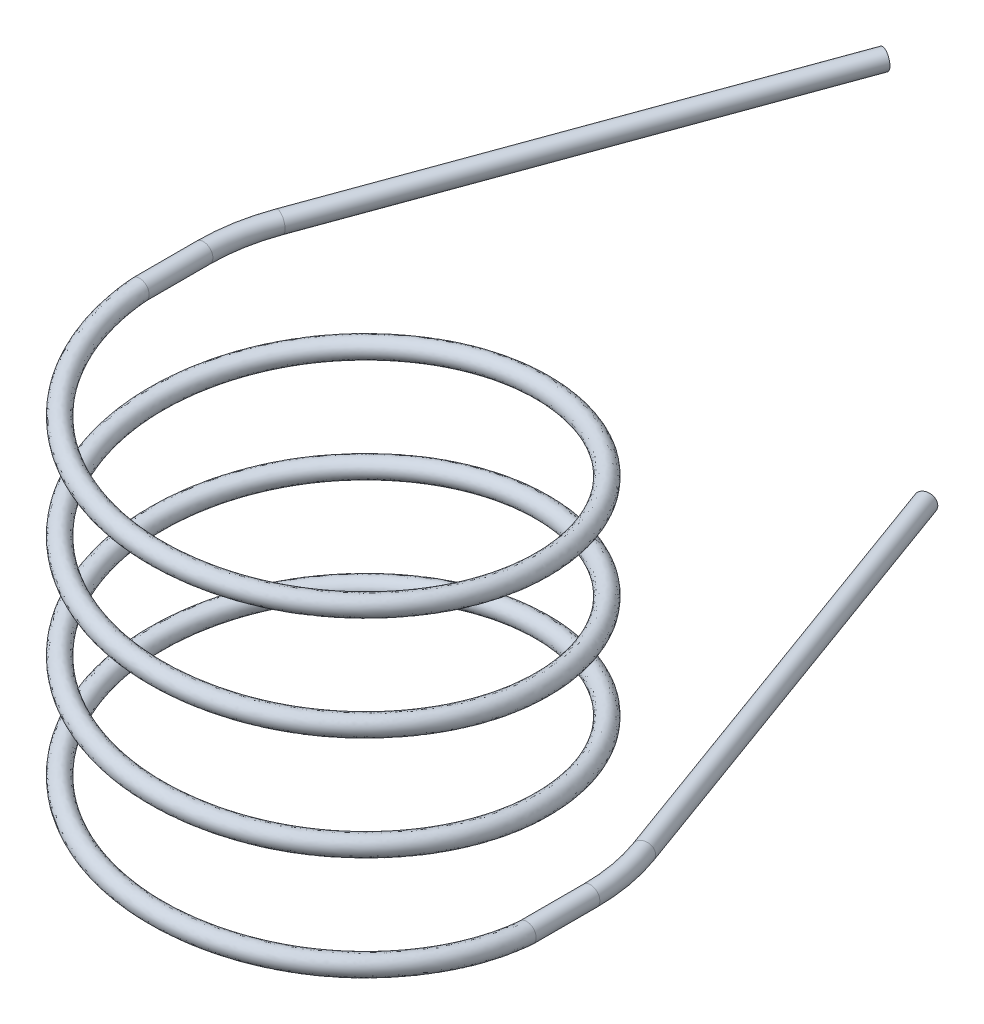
ISO-10303-21;
HEADER;
FILE_DESCRIPTION(('STEP AP214'),'2;1');
FILE_NAME('part.step','',(''),(''),'','','');
FILE_SCHEMA(('AUTOMOTIVE_DESIGN { 1 0 10303 214 1 1 1 1 }'));
ENDSEC;
DATA;
#1=APPLICATION_CONTEXT('core data for automotive mechanical design processes');
#2=APPLICATION_PROTOCOL_DEFINITION('international standard','automotive_design',2000,#1);
#3=PRODUCT_CONTEXT('',#1,'mechanical');
#4=PRODUCT('Part','Part','',(#3));
#5=PRODUCT_RELATED_PRODUCT_CATEGORY('part','',(#4));
#6=PRODUCT_DEFINITION_FORMATION('','',#4);
#7=PRODUCT_DEFINITION_CONTEXT('part definition',#1,'design');
#8=PRODUCT_DEFINITION('design','',#6,#7);
#9=PRODUCT_DEFINITION_SHAPE('','',#8);
#10=(LENGTH_UNIT() NAMED_UNIT(*) SI_UNIT(.MILLI.,.METRE.));
#11=(NAMED_UNIT(*) PLANE_ANGLE_UNIT() SI_UNIT($,.RADIAN.));
#12=(NAMED_UNIT(*) SI_UNIT($,.STERADIAN.) SOLID_ANGLE_UNIT());
#13=UNCERTAINTY_MEASURE_WITH_UNIT(LENGTH_MEASURE(1.E-05),#10,'distance_accuracy_value','');
#14=(GEOMETRIC_REPRESENTATION_CONTEXT(3) GLOBAL_UNCERTAINTY_ASSIGNED_CONTEXT((#13)) GLOBAL_UNIT_ASSIGNED_CONTEXT((#10,
#11,#12)) REPRESENTATION_CONTEXT('',''));
#15=CARTESIAN_POINT('',(0.,0.,0.));
#16=DIRECTION('',(0.,0.,1.));
#17=DIRECTION('',(1.,0.,0.));
#18=AXIS2_PLACEMENT_3D('',#15,#16,#17);
#19=CARTESIAN_POINT('',(-20.4999999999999,0.,-8.56393883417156E-13));
#20=DIRECTION('',(0.,0.,-1.));
#21=DIRECTION('',(-1.,0.,0.));
#22=AXIS2_PLACEMENT_3D('',#19,#20,#21);
#23=PLANE('',#22);
#24=CARTESIAN_POINT('',(-20.4999999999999,0.,-8.56393883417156E-13));
#25=DIRECTION('',(0.,0.,-1.));
#26=DIRECTION('',(-1.,0.,0.));
#27=AXIS2_PLACEMENT_3D('',#24,#25,#26);
#28=CIRCLE('',#27,1.);
#29=CARTESIAN_POINT('',(-19.5000007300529,-0.00120834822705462,-8.14618602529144E-13));
#30=VERTEX_POINT('',#29);
#31=CARTESIAN_POINT('',(-21.4999999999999,0.,-8.98169194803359E-13));
#32=VERTEX_POINT('',#31);
#33=EDGE_CURVE('E64',#30,#32,#28,.T.);
#34=ORIENTED_EDGE('',*,*,#33,.T.);
#35=CARTESIAN_POINT('',(-20.4999999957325,0.000418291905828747,-8.56394463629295E-13));
#36=DIRECTION('',(0.,0.,-1.));
#37=DIRECTION('',(-1.,0.,0.));
#38=AXIS2_PLACEMENT_3D('',#35,#36,#37);
#39=CIRCLE('',#38,1.);
#40=EDGE_CURVE('E47',#30,#32,#39,.T.);
#41=ORIENTED_EDGE('',*,*,#40,.F.);
#42=EDGE_LOOP('',(#34,#41));
#43=FACE_BOUND('',#42,.T.);
#44=ADVANCED_FACE('F33',(#43),#23,.T.);
#45=CARTESIAN_POINT('',(21.4999999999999,-38.5,-1.70429937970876E-13));
#46=CARTESIAN_POINT('',(21.5,-37.8125,8.90559159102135));
#47=CARTESIAN_POINT('',(15.2027957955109,-37.125,15.2027957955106));
#48=CARTESIAN_POINT('',(8.90559159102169,-36.4375,21.4999999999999));
#49=CARTESIAN_POINT('',(1.7174643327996E-13,-35.75,21.4999999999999));
#50=CARTESIAN_POINT('',(-8.90559159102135,-35.0625,21.5));
#51=CARTESIAN_POINT('',(-15.2027957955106,-34.375,15.2027957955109));
#52=CARTESIAN_POINT('',(-21.4999999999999,-33.6875,8.90559159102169));
#53=CARTESIAN_POINT('',(-21.4999999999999,-33.,1.73062928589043E-13));
#54=CARTESIAN_POINT('',(-21.5,-32.3125,-8.90559159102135));
#55=CARTESIAN_POINT('',(-15.2027957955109,-31.625,-15.2027957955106));
#56=CARTESIAN_POINT('',(-8.9055915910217,-30.9375,-21.4999999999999));
#57=CARTESIAN_POINT('',(-1.74379423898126E-13,-30.25,-21.4999999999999));
#58=CARTESIAN_POINT('',(8.90559159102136,-29.5625,-21.5));
#59=CARTESIAN_POINT('',(15.2027957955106,-28.875,-15.2027957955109));
#60=CARTESIAN_POINT('',(21.4999999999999,-28.1875,-8.9055915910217));
#61=CARTESIAN_POINT('',(21.4999999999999,-27.5,-1.70429937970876E-13));
#62=CARTESIAN_POINT('',(21.5,-26.8125,8.90559159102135));
#63=CARTESIAN_POINT('',(15.2027957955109,-26.125,15.2027957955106));
#64=CARTESIAN_POINT('',(8.90559159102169,-25.4375,21.4999999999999));
#65=CARTESIAN_POINT('',(1.7174643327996E-13,-24.75,21.4999999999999));
#66=CARTESIAN_POINT('',(-8.90559159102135,-24.0625,21.5));
#67=CARTESIAN_POINT('',(-15.2027957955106,-23.375,15.2027957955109));
#68=CARTESIAN_POINT('',(-21.4999999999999,-22.6875,8.90559159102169));
#69=CARTESIAN_POINT('',(-21.4999999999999,-22.,1.73062928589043E-13));
#70=CARTESIAN_POINT('',(-21.5,-21.3125,-8.90559159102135));
#71=CARTESIAN_POINT('',(-15.2027957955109,-20.625,-15.2027957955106));
#72=CARTESIAN_POINT('',(-8.9055915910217,-19.9375,-21.4999999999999));
#73=CARTESIAN_POINT('',(-1.74379423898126E-13,-19.25,-21.4999999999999));
#74=CARTESIAN_POINT('',(8.90559159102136,-18.5625,-21.5));
#75=CARTESIAN_POINT('',(15.2027957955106,-17.875,-15.2027957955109));
#76=CARTESIAN_POINT('',(21.4999999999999,-17.1875,-8.9055915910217));
#77=CARTESIAN_POINT('',(21.4999999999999,-16.5,-1.70429937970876E-13));
#78=CARTESIAN_POINT('',(21.5,-15.8125,8.90559159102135));
#79=CARTESIAN_POINT('',(15.2027957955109,-15.125,15.2027957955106));
#80=CARTESIAN_POINT('',(8.90559159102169,-14.4375,21.4999999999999));
#81=CARTESIAN_POINT('',(1.7174643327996E-13,-13.75,21.4999999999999));
#82=CARTESIAN_POINT('',(-8.90559159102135,-13.0625,21.5));
#83=CARTESIAN_POINT('',(-15.2027957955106,-12.375,15.2027957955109));
#84=CARTESIAN_POINT('',(-21.4999999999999,-11.6875,8.90559159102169));
#85=CARTESIAN_POINT('',(-21.4999999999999,-11.,1.73062928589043E-13));
#86=CARTESIAN_POINT('',(-21.5,-10.3125000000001,-8.90559159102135));
#87=CARTESIAN_POINT('',(-15.2027957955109,-9.62500000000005,-15.2027957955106));
#88=CARTESIAN_POINT('',(-8.9055915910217,-8.93750000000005,-21.4999999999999));
#89=CARTESIAN_POINT('',(-1.74379423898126E-13,-8.25000000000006,-21.4999999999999));
#90=CARTESIAN_POINT('',(8.90559159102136,-7.56250000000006,-21.5));
#91=CARTESIAN_POINT('',(15.2027957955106,-6.87500000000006,-15.2027957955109));
#92=CARTESIAN_POINT('',(21.4999999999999,-6.18750000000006,-8.9055915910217));
#93=CARTESIAN_POINT('',(21.4999999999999,-5.50000000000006,-1.70429937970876E-13));
#94=CARTESIAN_POINT('',(21.5,-4.81250000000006,8.90559159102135));
#95=CARTESIAN_POINT('',(15.2027957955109,-4.12500000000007,15.2027957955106));
#96=CARTESIAN_POINT('',(8.90559159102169,-3.43750000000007,21.4999999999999));
#97=CARTESIAN_POINT('',(1.7174643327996E-13,-2.75000000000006,21.4999999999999));
#98=CARTESIAN_POINT('',(-8.90559159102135,-2.06250000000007,21.5));
#99=CARTESIAN_POINT('',(-15.2027957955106,-1.37500000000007,15.2027957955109));
#100=CARTESIAN_POINT('',(-21.4999999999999,-0.68750000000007,8.90559159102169));
#101=CARTESIAN_POINT('',(-21.4999999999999,0.,1.73062928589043E-13));
#102=CARTESIAN_POINT('',(-21.5,0.687499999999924,-8.90559159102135));
#103=CARTESIAN_POINT('',(-15.2027957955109,1.37499999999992,-15.2027957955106));
#104=CARTESIAN_POINT('',(-8.9055915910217,2.06249999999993,-21.4999999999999));
#105=CARTESIAN_POINT('',(-1.74379423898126E-13,2.74999999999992,-21.4999999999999));
#106=CARTESIAN_POINT('',(8.90559159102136,3.43749999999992,-21.5));
#107=CARTESIAN_POINT('',(15.2027957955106,4.12499999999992,-15.2027957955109));
#108=CARTESIAN_POINT('',(21.4999999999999,4.81249999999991,-8.9055915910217));
#109=CARTESIAN_POINT('',(21.4999999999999,5.49999999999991,-1.70429937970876E-13));
#110=CARTESIAN_POINT('',(21.4999999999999,-36.5,-1.70429937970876E-13));
#111=CARTESIAN_POINT('',(21.5,-35.8125,8.90559159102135));
#112=CARTESIAN_POINT('',(15.2027957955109,-35.125,15.2027957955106));
#113=CARTESIAN_POINT('',(8.90559159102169,-34.4375,21.4999999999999));
#114=CARTESIAN_POINT('',(1.7174643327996E-13,-33.75,21.4999999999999));
#115=CARTESIAN_POINT('',(-8.90559159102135,-33.0625,21.5));
#116=CARTESIAN_POINT('',(-15.2027957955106,-32.375,15.2027957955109));
#117=CARTESIAN_POINT('',(-21.4999999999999,-31.6875,8.90559159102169));
#118=CARTESIAN_POINT('',(-21.4999999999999,-31.,1.73062928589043E-13));
#119=CARTESIAN_POINT('',(-21.5,-30.3125,-8.90559159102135));
#120=CARTESIAN_POINT('',(-15.2027957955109,-29.625,-15.2027957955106));
#121=CARTESIAN_POINT('',(-8.9055915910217,-28.9375,-21.4999999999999));
#122=CARTESIAN_POINT('',(-1.74379423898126E-13,-28.25,-21.4999999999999));
#123=CARTESIAN_POINT('',(8.90559159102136,-27.5625,-21.5));
#124=CARTESIAN_POINT('',(15.2027957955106,-26.875,-15.2027957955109));
#125=CARTESIAN_POINT('',(21.4999999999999,-26.1875,-8.9055915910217));
#126=CARTESIAN_POINT('',(21.4999999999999,-25.5,-1.70429937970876E-13));
#127=CARTESIAN_POINT('',(21.5,-24.8125,8.90559159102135));
#128=CARTESIAN_POINT('',(15.2027957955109,-24.125,15.2027957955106));
#129=CARTESIAN_POINT('',(8.90559159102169,-23.4375,21.4999999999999));
#130=CARTESIAN_POINT('',(1.7174643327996E-13,-22.75,21.4999999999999));
#131=CARTESIAN_POINT('',(-8.90559159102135,-22.0625,21.5));
#132=CARTESIAN_POINT('',(-15.2027957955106,-21.375,15.2027957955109));
#133=CARTESIAN_POINT('',(-21.4999999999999,-20.6875,8.90559159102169));
#134=CARTESIAN_POINT('',(-21.4999999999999,-20.,1.73062928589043E-13));
#135=CARTESIAN_POINT('',(-21.5,-19.3125,-8.90559159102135));
#136=CARTESIAN_POINT('',(-15.2027957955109,-18.625,-15.2027957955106));
#137=CARTESIAN_POINT('',(-8.9055915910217,-17.9375,-21.4999999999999));
#138=CARTESIAN_POINT('',(-1.74379423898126E-13,-17.25,-21.4999999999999));
#139=CARTESIAN_POINT('',(8.90559159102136,-16.5625,-21.5));
#140=CARTESIAN_POINT('',(15.2027957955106,-15.875,-15.2027957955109));
#141=CARTESIAN_POINT('',(21.4999999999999,-15.1875,-8.9055915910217));
#142=CARTESIAN_POINT('',(21.4999999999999,-14.5,-1.70429937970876E-13));
#143=CARTESIAN_POINT('',(21.5,-13.8125,8.90559159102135));
#144=CARTESIAN_POINT('',(15.2027957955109,-13.125,15.2027957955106));
#145=CARTESIAN_POINT('',(8.90559159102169,-12.4375,21.4999999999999));
#146=CARTESIAN_POINT('',(1.7174643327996E-13,-11.75,21.4999999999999));
#147=CARTESIAN_POINT('',(-8.90559159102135,-11.0625,21.5));
#148=CARTESIAN_POINT('',(-15.2027957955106,-10.375,15.2027957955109));
#149=CARTESIAN_POINT('',(-21.4999999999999,-9.68750000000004,8.90559159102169));
#150=CARTESIAN_POINT('',(-21.4999999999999,-9.00000000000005,1.73062928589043E-13));
#151=CARTESIAN_POINT('',(-21.5,-8.31250000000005,-8.90559159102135));
#152=CARTESIAN_POINT('',(-15.2027957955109,-7.62500000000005,-15.2027957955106));
#153=CARTESIAN_POINT('',(-8.9055915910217,-6.93750000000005,-21.4999999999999));
#154=CARTESIAN_POINT('',(-1.74379423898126E-13,-6.25000000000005,-21.4999999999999));
#155=CARTESIAN_POINT('',(8.90559159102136,-5.56250000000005,-21.5));
#156=CARTESIAN_POINT('',(15.2027957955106,-4.87500000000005,-15.2027957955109));
#157=CARTESIAN_POINT('',(21.4999999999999,-4.18750000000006,-8.9055915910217));
#158=CARTESIAN_POINT('',(21.4999999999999,-3.50000000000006,-1.70429937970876E-13));
#159=CARTESIAN_POINT('',(21.5,-2.81250000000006,8.90559159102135));
#160=CARTESIAN_POINT('',(15.2027957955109,-2.12500000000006,15.2027957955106));
#161=CARTESIAN_POINT('',(8.90559159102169,-1.43750000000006,21.4999999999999));
#162=CARTESIAN_POINT('',(1.7174643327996E-13,-0.750000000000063,21.4999999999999));
#163=CARTESIAN_POINT('',(-8.90559159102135,-0.0625000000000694,21.5));
#164=CARTESIAN_POINT('',(-15.2027957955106,0.624999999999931,15.2027957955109));
#165=CARTESIAN_POINT('',(-21.4999999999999,1.31249999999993,8.90559159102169));
#166=CARTESIAN_POINT('',(-21.4999999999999,1.99999999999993,1.73062928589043E-13));
#167=CARTESIAN_POINT('',(-21.5,2.68749999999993,-8.90559159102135));
#168=CARTESIAN_POINT('',(-15.2027957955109,3.37499999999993,-15.2027957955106));
#169=CARTESIAN_POINT('',(-8.9055915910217,4.06249999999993,-21.4999999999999));
#170=CARTESIAN_POINT('',(-1.74379423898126E-13,4.74999999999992,-21.4999999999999));
#171=CARTESIAN_POINT('',(8.90559159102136,5.43749999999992,-21.5));
#172=CARTESIAN_POINT('',(15.2027957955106,6.12499999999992,-15.2027957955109));
#173=CARTESIAN_POINT('',(21.4999999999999,6.81249999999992,-8.9055915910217));
#174=CARTESIAN_POINT('',(21.4999999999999,7.49999999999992,-1.70429937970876E-13));
#175=CARTESIAN_POINT('',(19.4999999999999,-36.5,-1.54575990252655E-13));
#176=CARTESIAN_POINT('',(19.5,-35.8125,8.07716446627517));
#177=CARTESIAN_POINT('',(13.7885822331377,-35.125,13.7885822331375));
#178=CARTESIAN_POINT('',(8.07716446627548,-34.4375,19.4999999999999));
#179=CARTESIAN_POINT('',(1.55770020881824E-13,-33.75,19.4999999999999));
#180=CARTESIAN_POINT('',(-8.07716446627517,-33.0625,19.5));
#181=CARTESIAN_POINT('',(-13.7885822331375,-32.375,13.7885822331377));
#182=CARTESIAN_POINT('',(-19.4999999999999,-31.6875,8.07716446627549));
#183=CARTESIAN_POINT('',(-19.4999999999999,-31.,1.56964051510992E-13));
#184=CARTESIAN_POINT('',(-19.5,-30.3125,-8.07716446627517));
#185=CARTESIAN_POINT('',(-13.7885822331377,-29.625,-13.7885822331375));
#186=CARTESIAN_POINT('',(-8.07716446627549,-28.9375,-19.4999999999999));
#187=CARTESIAN_POINT('',(-1.58158082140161E-13,-28.25,-19.4999999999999));
#188=CARTESIAN_POINT('',(8.07716446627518,-27.5625,-19.5));
#189=CARTESIAN_POINT('',(13.7885822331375,-26.875,-13.7885822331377));
#190=CARTESIAN_POINT('',(19.4999999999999,-26.1875,-8.07716446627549));
#191=CARTESIAN_POINT('',(19.4999999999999,-25.5,-1.54575990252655E-13));
#192=CARTESIAN_POINT('',(19.5,-24.8125,8.07716446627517));
#193=CARTESIAN_POINT('',(13.7885822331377,-24.125,13.7885822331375));
#194=CARTESIAN_POINT('',(8.07716446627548,-23.4375,19.4999999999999));
#195=CARTESIAN_POINT('',(1.55770020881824E-13,-22.75,19.4999999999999));
#196=CARTESIAN_POINT('',(-8.07716446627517,-22.0625,19.5));
#197=CARTESIAN_POINT('',(-13.7885822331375,-21.375,13.7885822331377));
#198=CARTESIAN_POINT('',(-19.4999999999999,-20.6875,8.07716446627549));
#199=CARTESIAN_POINT('',(-19.4999999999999,-20.,1.56964051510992E-13));
#200=CARTESIAN_POINT('',(-19.5,-19.3125,-8.07716446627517));
#201=CARTESIAN_POINT('',(-13.7885822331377,-18.625,-13.7885822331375));
#202=CARTESIAN_POINT('',(-8.07716446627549,-17.9375,-19.4999999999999));
#203=CARTESIAN_POINT('',(-1.58158082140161E-13,-17.25,-19.4999999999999));
#204=CARTESIAN_POINT('',(8.07716446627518,-16.5625,-19.5));
#205=CARTESIAN_POINT('',(13.7885822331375,-15.875,-13.7885822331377));
#206=CARTESIAN_POINT('',(19.4999999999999,-15.1875,-8.07716446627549));
#207=CARTESIAN_POINT('',(19.4999999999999,-14.5,-1.54575990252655E-13));
#208=CARTESIAN_POINT('',(19.5,-13.8125,8.07716446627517));
#209=CARTESIAN_POINT('',(13.7885822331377,-13.125,13.7885822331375));
#210=CARTESIAN_POINT('',(8.07716446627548,-12.4375,19.4999999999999));
#211=CARTESIAN_POINT('',(1.55770020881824E-13,-11.75,19.4999999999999));
#212=CARTESIAN_POINT('',(-8.07716446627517,-11.0625,19.5));
#213=CARTESIAN_POINT('',(-13.7885822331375,-10.375,13.7885822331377));
#214=CARTESIAN_POINT('',(-19.4999999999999,-9.68750000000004,8.07716446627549));
#215=CARTESIAN_POINT('',(-19.4999999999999,-9.00000000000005,1.56964051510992E-13));
#216=CARTESIAN_POINT('',(-19.5,-8.31250000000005,-8.07716446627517));
#217=CARTESIAN_POINT('',(-13.7885822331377,-7.62500000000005,-13.7885822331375));
#218=CARTESIAN_POINT('',(-8.07716446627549,-6.93750000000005,-19.4999999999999));
#219=CARTESIAN_POINT('',(-1.58158082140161E-13,-6.25000000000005,-19.4999999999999));
#220=CARTESIAN_POINT('',(8.07716446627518,-5.56250000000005,-19.5));
#221=CARTESIAN_POINT('',(13.7885822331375,-4.87500000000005,-13.7885822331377));
#222=CARTESIAN_POINT('',(19.4999999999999,-4.18750000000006,-8.07716446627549));
#223=CARTESIAN_POINT('',(19.4999999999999,-3.50000000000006,-1.54575990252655E-13));
#224=CARTESIAN_POINT('',(19.5,-2.81250000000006,8.07716446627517));
#225=CARTESIAN_POINT('',(13.7885822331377,-2.12500000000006,13.7885822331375));
#226=CARTESIAN_POINT('',(8.07716446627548,-1.43750000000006,19.4999999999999));
#227=CARTESIAN_POINT('',(1.55770020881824E-13,-0.750000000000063,19.4999999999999));
#228=CARTESIAN_POINT('',(-8.07716446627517,-0.0625000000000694,19.5));
#229=CARTESIAN_POINT('',(-13.7885822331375,0.624999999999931,13.7885822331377));
#230=CARTESIAN_POINT('',(-19.4999999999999,1.31249999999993,8.07716446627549));
#231=CARTESIAN_POINT('',(-19.4999999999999,1.99999999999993,1.56964051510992E-13));
#232=CARTESIAN_POINT('',(-19.5,2.68749999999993,-8.07716446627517));
#233=CARTESIAN_POINT('',(-13.7885822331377,3.37499999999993,-13.7885822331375));
#234=CARTESIAN_POINT('',(-8.07716446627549,4.06249999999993,-19.4999999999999));
#235=CARTESIAN_POINT('',(-1.58158082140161E-13,4.74999999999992,-19.4999999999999));
#236=CARTESIAN_POINT('',(8.07716446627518,5.43749999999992,-19.5));
#237=CARTESIAN_POINT('',(13.7885822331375,6.12499999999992,-13.7885822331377));
#238=CARTESIAN_POINT('',(19.4999999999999,6.81249999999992,-8.07716446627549));
#239=CARTESIAN_POINT('',(19.4999999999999,7.49999999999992,-1.54575990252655E-13));
#240=CARTESIAN_POINT('',(19.4999999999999,-38.5,-1.54575990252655E-13));
#241=CARTESIAN_POINT('',(19.5,-37.8125,8.07716446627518));
#242=CARTESIAN_POINT('',(13.7885822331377,-37.125,13.7885822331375));
#243=CARTESIAN_POINT('',(8.07716446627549,-36.4375,19.4999999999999));
#244=CARTESIAN_POINT('',(1.55770020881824E-13,-35.75,19.4999999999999));
#245=CARTESIAN_POINT('',(-8.07716446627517,-35.0625,19.5));
#246=CARTESIAN_POINT('',(-13.7885822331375,-34.375,13.7885822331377));
#247=CARTESIAN_POINT('',(-19.4999999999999,-33.6875,8.07716446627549));
#248=CARTESIAN_POINT('',(-19.4999999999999,-33.,1.56964051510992E-13));
#249=CARTESIAN_POINT('',(-19.5,-32.3125,-8.07716446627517));
#250=CARTESIAN_POINT('',(-13.7885822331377,-31.625,-13.7885822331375));
#251=CARTESIAN_POINT('',(-8.07716446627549,-30.9375,-19.4999999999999));
#252=CARTESIAN_POINT('',(-1.58158082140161E-13,-30.25,-19.4999999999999));
#253=CARTESIAN_POINT('',(8.07716446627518,-29.5625,-19.5));
#254=CARTESIAN_POINT('',(13.7885822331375,-28.875,-13.7885822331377));
#255=CARTESIAN_POINT('',(19.4999999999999,-28.1875,-8.0771644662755));
#256=CARTESIAN_POINT('',(19.4999999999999,-27.5,-1.54575990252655E-13));
#257=CARTESIAN_POINT('',(19.5,-26.8125,8.07716446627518));
#258=CARTESIAN_POINT('',(13.7885822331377,-26.125,13.7885822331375));
#259=CARTESIAN_POINT('',(8.07716446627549,-25.4375,19.4999999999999));
#260=CARTESIAN_POINT('',(1.55770020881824E-13,-24.75,19.4999999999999));
#261=CARTESIAN_POINT('',(-8.07716446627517,-24.0625,19.5));
#262=CARTESIAN_POINT('',(-13.7885822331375,-23.375,13.7885822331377));
#263=CARTESIAN_POINT('',(-19.4999999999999,-22.6875,8.07716446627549));
#264=CARTESIAN_POINT('',(-19.4999999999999,-22.,1.56964051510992E-13));
#265=CARTESIAN_POINT('',(-19.5,-21.3125,-8.07716446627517));
#266=CARTESIAN_POINT('',(-13.7885822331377,-20.625,-13.7885822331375));
#267=CARTESIAN_POINT('',(-8.07716446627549,-19.9375,-19.4999999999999));
#268=CARTESIAN_POINT('',(-1.58158082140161E-13,-19.25,-19.4999999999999));
#269=CARTESIAN_POINT('',(8.07716446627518,-18.5625,-19.5));
#270=CARTESIAN_POINT('',(13.7885822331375,-17.875,-13.7885822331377));
#271=CARTESIAN_POINT('',(19.4999999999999,-17.1875,-8.0771644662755));
#272=CARTESIAN_POINT('',(19.4999999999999,-16.5,-1.54575990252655E-13));
#273=CARTESIAN_POINT('',(19.5,-15.8125,8.07716446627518));
#274=CARTESIAN_POINT('',(13.7885822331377,-15.125,13.7885822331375));
#275=CARTESIAN_POINT('',(8.07716446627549,-14.4375,19.4999999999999));
#276=CARTESIAN_POINT('',(1.55770020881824E-13,-13.75,19.4999999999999));
#277=CARTESIAN_POINT('',(-8.07716446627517,-13.0625,19.5));
#278=CARTESIAN_POINT('',(-13.7885822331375,-12.375,13.7885822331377));
#279=CARTESIAN_POINT('',(-19.4999999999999,-11.6875,8.07716446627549));
#280=CARTESIAN_POINT('',(-19.4999999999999,-11.,1.56964051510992E-13));
#281=CARTESIAN_POINT('',(-19.5,-10.3125000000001,-8.07716446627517));
#282=CARTESIAN_POINT('',(-13.7885822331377,-9.62500000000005,-13.7885822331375));
#283=CARTESIAN_POINT('',(-8.07716446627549,-8.93750000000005,-19.4999999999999));
#284=CARTESIAN_POINT('',(-1.58158082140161E-13,-8.25000000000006,-19.4999999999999));
#285=CARTESIAN_POINT('',(8.07716446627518,-7.56250000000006,-19.5));
#286=CARTESIAN_POINT('',(13.7885822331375,-6.87500000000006,-13.7885822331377));
#287=CARTESIAN_POINT('',(19.4999999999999,-6.18750000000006,-8.0771644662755));
#288=CARTESIAN_POINT('',(19.4999999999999,-5.50000000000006,-1.54575990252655E-13));
#289=CARTESIAN_POINT('',(19.5,-4.81250000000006,8.07716446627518));
#290=CARTESIAN_POINT('',(13.7885822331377,-4.12500000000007,13.7885822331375));
#291=CARTESIAN_POINT('',(8.07716446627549,-3.43750000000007,19.4999999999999));
#292=CARTESIAN_POINT('',(1.55770020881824E-13,-2.75000000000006,19.4999999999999));
#293=CARTESIAN_POINT('',(-8.07716446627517,-2.06250000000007,19.5));
#294=CARTESIAN_POINT('',(-13.7885822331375,-1.37500000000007,13.7885822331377));
#295=CARTESIAN_POINT('',(-19.4999999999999,-0.68750000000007,8.07716446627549));
#296=CARTESIAN_POINT('',(-19.4999999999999,0.,1.56964051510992E-13));
#297=CARTESIAN_POINT('',(-19.5,0.687499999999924,-8.07716446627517));
#298=CARTESIAN_POINT('',(-13.7885822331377,1.37499999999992,-13.7885822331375));
#299=CARTESIAN_POINT('',(-8.07716446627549,2.06249999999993,-19.4999999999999));
#300=CARTESIAN_POINT('',(-1.58158082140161E-13,2.74999999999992,-19.4999999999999));
#301=CARTESIAN_POINT('',(8.07716446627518,3.43749999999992,-19.5));
#302=CARTESIAN_POINT('',(13.7885822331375,4.12499999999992,-13.7885822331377));
#303=CARTESIAN_POINT('',(19.4999999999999,4.81249999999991,-8.0771644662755));
#304=CARTESIAN_POINT('',(19.4999999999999,5.49999999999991,-1.54575990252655E-13));
#305=CARTESIAN_POINT('',(19.4999999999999,-40.5,-1.54575990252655E-13));
#306=CARTESIAN_POINT('',(19.5,-39.8125,8.07716446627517));
#307=CARTESIAN_POINT('',(13.7885822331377,-39.125,13.7885822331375));
#308=CARTESIAN_POINT('',(8.07716446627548,-38.4375,19.4999999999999));
#309=CARTESIAN_POINT('',(1.55770020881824E-13,-37.75,19.4999999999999));
#310=CARTESIAN_POINT('',(-8.07716446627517,-37.0625,19.5));
#311=CARTESIAN_POINT('',(-13.7885822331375,-36.375,13.7885822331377));
#312=CARTESIAN_POINT('',(-19.4999999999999,-35.6875,8.07716446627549));
#313=CARTESIAN_POINT('',(-19.4999999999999,-35.,1.56964051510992E-13));
#314=CARTESIAN_POINT('',(-19.5,-34.3125,-8.07716446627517));
#315=CARTESIAN_POINT('',(-13.7885822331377,-33.625,-13.7885822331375));
#316=CARTESIAN_POINT('',(-8.07716446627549,-32.9375,-19.4999999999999));
#317=CARTESIAN_POINT('',(-1.58158082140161E-13,-32.25,-19.4999999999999));
#318=CARTESIAN_POINT('',(8.07716446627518,-31.5625,-19.5));
#319=CARTESIAN_POINT('',(13.7885822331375,-30.875,-13.7885822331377));
#320=CARTESIAN_POINT('',(19.4999999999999,-30.1875,-8.07716446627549));
#321=CARTESIAN_POINT('',(19.4999999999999,-29.5,-1.54575990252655E-13));
#322=CARTESIAN_POINT('',(19.5,-28.8125,8.07716446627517));
#323=CARTESIAN_POINT('',(13.7885822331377,-28.125,13.7885822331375));
#324=CARTESIAN_POINT('',(8.07716446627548,-27.4375,19.4999999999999));
#325=CARTESIAN_POINT('',(1.55770020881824E-13,-26.75,19.4999999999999));
#326=CARTESIAN_POINT('',(-8.07716446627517,-26.0625,19.5));
#327=CARTESIAN_POINT('',(-13.7885822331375,-25.375,13.7885822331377));
#328=CARTESIAN_POINT('',(-19.4999999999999,-24.6875,8.07716446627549));
#329=CARTESIAN_POINT('',(-19.4999999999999,-24.,1.56964051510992E-13));
#330=CARTESIAN_POINT('',(-19.5,-23.3125,-8.07716446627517));
#331=CARTESIAN_POINT('',(-13.7885822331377,-22.625,-13.7885822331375));
#332=CARTESIAN_POINT('',(-8.07716446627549,-21.9375,-19.4999999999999));
#333=CARTESIAN_POINT('',(-1.58158082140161E-13,-21.25,-19.4999999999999));
#334=CARTESIAN_POINT('',(8.07716446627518,-20.5625,-19.5));
#335=CARTESIAN_POINT('',(13.7885822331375,-19.875,-13.7885822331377));
#336=CARTESIAN_POINT('',(19.4999999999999,-19.1875,-8.07716446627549));
#337=CARTESIAN_POINT('',(19.4999999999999,-18.5,-1.54575990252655E-13));
#338=CARTESIAN_POINT('',(19.5,-17.8125,8.07716446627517));
#339=CARTESIAN_POINT('',(13.7885822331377,-17.125,13.7885822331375));
#340=CARTESIAN_POINT('',(8.07716446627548,-16.4375,19.4999999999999));
#341=CARTESIAN_POINT('',(1.55770020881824E-13,-15.75,19.4999999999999));
#342=CARTESIAN_POINT('',(-8.07716446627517,-15.0625,19.5));
#343=CARTESIAN_POINT('',(-13.7885822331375,-14.375,13.7885822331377));
#344=CARTESIAN_POINT('',(-19.4999999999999,-13.6875,8.07716446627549));
#345=CARTESIAN_POINT('',(-19.4999999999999,-13.,1.56964051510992E-13));
#346=CARTESIAN_POINT('',(-19.5,-12.3125000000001,-8.07716446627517));
#347=CARTESIAN_POINT('',(-13.7885822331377,-11.6250000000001,-13.7885822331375));
#348=CARTESIAN_POINT('',(-8.07716446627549,-10.9375000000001,-19.4999999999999));
#349=CARTESIAN_POINT('',(-1.58158082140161E-13,-10.2500000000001,-19.4999999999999));
#350=CARTESIAN_POINT('',(8.07716446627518,-9.56250000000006,-19.5));
#351=CARTESIAN_POINT('',(13.7885822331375,-8.87500000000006,-13.7885822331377));
#352=CARTESIAN_POINT('',(19.4999999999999,-8.18750000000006,-8.07716446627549));
#353=CARTESIAN_POINT('',(19.4999999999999,-7.50000000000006,-1.54575990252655E-13));
#354=CARTESIAN_POINT('',(19.5,-6.81250000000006,8.07716446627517));
#355=CARTESIAN_POINT('',(13.7885822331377,-6.12500000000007,13.7885822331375));
#356=CARTESIAN_POINT('',(8.07716446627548,-5.43750000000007,19.4999999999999));
#357=CARTESIAN_POINT('',(1.55770020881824E-13,-4.75000000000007,19.4999999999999));
#358=CARTESIAN_POINT('',(-8.07716446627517,-4.06250000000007,19.5));
#359=CARTESIAN_POINT('',(-13.7885822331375,-3.37500000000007,13.7885822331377));
#360=CARTESIAN_POINT('',(-19.4999999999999,-2.68750000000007,8.07716446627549));
#361=CARTESIAN_POINT('',(-19.4999999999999,-2.00000000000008,1.56964051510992E-13));
#362=CARTESIAN_POINT('',(-19.5,-1.31250000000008,-8.07716446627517));
#363=CARTESIAN_POINT('',(-13.7885822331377,-0.625000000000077,-13.7885822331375));
#364=CARTESIAN_POINT('',(-8.07716446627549,0.0624999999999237,-19.4999999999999));
#365=CARTESIAN_POINT('',(-1.58158082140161E-13,0.749999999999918,-19.4999999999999));
#366=CARTESIAN_POINT('',(8.07716446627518,1.43749999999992,-19.5));
#367=CARTESIAN_POINT('',(13.7885822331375,2.12499999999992,-13.7885822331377));
#368=CARTESIAN_POINT('',(19.4999999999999,2.81249999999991,-8.07716446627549));
#369=CARTESIAN_POINT('',(19.4999999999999,3.49999999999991,-1.54575990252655E-13));
#370=CARTESIAN_POINT('',(21.4999999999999,-40.5,-1.70429937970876E-13));
#371=CARTESIAN_POINT('',(21.5,-39.8125,8.90559159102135));
#372=CARTESIAN_POINT('',(15.2027957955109,-39.125,15.2027957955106));
#373=CARTESIAN_POINT('',(8.90559159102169,-38.4375,21.4999999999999));
#374=CARTESIAN_POINT('',(1.7174643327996E-13,-37.75,21.4999999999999));
#375=CARTESIAN_POINT('',(-8.90559159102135,-37.0625,21.5));
#376=CARTESIAN_POINT('',(-15.2027957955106,-36.375,15.2027957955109));
#377=CARTESIAN_POINT('',(-21.4999999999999,-35.6875,8.90559159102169));
#378=CARTESIAN_POINT('',(-21.4999999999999,-35.,1.73062928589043E-13));
#379=CARTESIAN_POINT('',(-21.5,-34.3125,-8.90559159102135));
#380=CARTESIAN_POINT('',(-15.2027957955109,-33.625,-15.2027957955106));
#381=CARTESIAN_POINT('',(-8.9055915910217,-32.9375,-21.4999999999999));
#382=CARTESIAN_POINT('',(-1.74379423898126E-13,-32.25,-21.4999999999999));
#383=CARTESIAN_POINT('',(8.90559159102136,-31.5625,-21.5));
#384=CARTESIAN_POINT('',(15.2027957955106,-30.875,-15.2027957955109));
#385=CARTESIAN_POINT('',(21.4999999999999,-30.1875,-8.9055915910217));
#386=CARTESIAN_POINT('',(21.4999999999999,-29.5,-1.70429937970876E-13));
#387=CARTESIAN_POINT('',(21.5,-28.8125,8.90559159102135));
#388=CARTESIAN_POINT('',(15.2027957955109,-28.125,15.2027957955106));
#389=CARTESIAN_POINT('',(8.90559159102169,-27.4375,21.4999999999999));
#390=CARTESIAN_POINT('',(1.7174643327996E-13,-26.75,21.4999999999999));
#391=CARTESIAN_POINT('',(-8.90559159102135,-26.0625,21.5));
#392=CARTESIAN_POINT('',(-15.2027957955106,-25.375,15.2027957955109));
#393=CARTESIAN_POINT('',(-21.4999999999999,-24.6875,8.90559159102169));
#394=CARTESIAN_POINT('',(-21.4999999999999,-24.,1.73062928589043E-13));
#395=CARTESIAN_POINT('',(-21.5,-23.3125,-8.90559159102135));
#396=CARTESIAN_POINT('',(-15.2027957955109,-22.625,-15.2027957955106));
#397=CARTESIAN_POINT('',(-8.9055915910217,-21.9375,-21.4999999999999));
#398=CARTESIAN_POINT('',(-1.74379423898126E-13,-21.25,-21.4999999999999));
#399=CARTESIAN_POINT('',(8.90559159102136,-20.5625,-21.5));
#400=CARTESIAN_POINT('',(15.2027957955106,-19.875,-15.2027957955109));
#401=CARTESIAN_POINT('',(21.4999999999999,-19.1875,-8.9055915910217));
#402=CARTESIAN_POINT('',(21.4999999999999,-18.5,-1.70429937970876E-13));
#403=CARTESIAN_POINT('',(21.5,-17.8125,8.90559159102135));
#404=CARTESIAN_POINT('',(15.2027957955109,-17.125,15.2027957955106));
#405=CARTESIAN_POINT('',(8.90559159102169,-16.4375,21.4999999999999));
#406=CARTESIAN_POINT('',(1.7174643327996E-13,-15.75,21.4999999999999));
#407=CARTESIAN_POINT('',(-8.90559159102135,-15.0625,21.5));
#408=CARTESIAN_POINT('',(-15.2027957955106,-14.375,15.2027957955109));
#409=CARTESIAN_POINT('',(-21.4999999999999,-13.6875,8.90559159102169));
#410=CARTESIAN_POINT('',(-21.4999999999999,-13.,1.73062928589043E-13));
#411=CARTESIAN_POINT('',(-21.5,-12.3125000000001,-8.90559159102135));
#412=CARTESIAN_POINT('',(-15.2027957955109,-11.6250000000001,-15.2027957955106));
#413=CARTESIAN_POINT('',(-8.9055915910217,-10.9375000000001,-21.4999999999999));
#414=CARTESIAN_POINT('',(-1.74379423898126E-13,-10.2500000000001,-21.4999999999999));
#415=CARTESIAN_POINT('',(8.90559159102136,-9.56250000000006,-21.5));
#416=CARTESIAN_POINT('',(15.2027957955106,-8.87500000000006,-15.2027957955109));
#417=CARTESIAN_POINT('',(21.4999999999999,-8.18750000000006,-8.9055915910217));
#418=CARTESIAN_POINT('',(21.4999999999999,-7.50000000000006,-1.70429937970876E-13));
#419=CARTESIAN_POINT('',(21.5,-6.81250000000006,8.90559159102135));
#420=CARTESIAN_POINT('',(15.2027957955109,-6.12500000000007,15.2027957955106));
#421=CARTESIAN_POINT('',(8.90559159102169,-5.43750000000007,21.4999999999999));
#422=CARTESIAN_POINT('',(1.7174643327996E-13,-4.75000000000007,21.4999999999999));
#423=CARTESIAN_POINT('',(-8.90559159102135,-4.06250000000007,21.5));
#424=CARTESIAN_POINT('',(-15.2027957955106,-3.37500000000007,15.2027957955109));
#425=CARTESIAN_POINT('',(-21.4999999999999,-2.68750000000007,8.90559159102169));
#426=CARTESIAN_POINT('',(-21.4999999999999,-2.00000000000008,1.73062928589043E-13));
#427=CARTESIAN_POINT('',(-21.5,-1.31250000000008,-8.90559159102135));
#428=CARTESIAN_POINT('',(-15.2027957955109,-0.625000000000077,-15.2027957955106));
#429=CARTESIAN_POINT('',(-8.9055915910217,0.0624999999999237,-21.4999999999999));
#430=CARTESIAN_POINT('',(-1.74379423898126E-13,0.749999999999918,-21.4999999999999));
#431=CARTESIAN_POINT('',(8.90559159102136,1.43749999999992,-21.5));
#432=CARTESIAN_POINT('',(15.2027957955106,2.12499999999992,-15.2027957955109));
#433=CARTESIAN_POINT('',(21.4999999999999,2.81249999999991,-8.9055915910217));
#434=CARTESIAN_POINT('',(21.4999999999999,3.49999999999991,-1.70429937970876E-13));
#435=CARTESIAN_POINT('',(21.4999999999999,-38.5,-1.70429937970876E-13));
#436=CARTESIAN_POINT('',(21.5,-37.8125,8.90559159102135));
#437=CARTESIAN_POINT('',(15.2027957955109,-37.125,15.2027957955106));
#438=CARTESIAN_POINT('',(8.90559159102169,-36.4375,21.4999999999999));
#439=CARTESIAN_POINT('',(1.7174643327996E-13,-35.75,21.4999999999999));
#440=CARTESIAN_POINT('',(-8.90559159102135,-35.0625,21.5));
#441=CARTESIAN_POINT('',(-15.2027957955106,-34.375,15.2027957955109));
#442=CARTESIAN_POINT('',(-21.4999999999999,-33.6875,8.90559159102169));
#443=CARTESIAN_POINT('',(-21.4999999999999,-33.,1.73062928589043E-13));
#444=CARTESIAN_POINT('',(-21.5,-32.3125,-8.90559159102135));
#445=CARTESIAN_POINT('',(-15.2027957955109,-31.625,-15.2027957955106));
#446=CARTESIAN_POINT('',(-8.9055915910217,-30.9375,-21.4999999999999));
#447=CARTESIAN_POINT('',(-1.74379423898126E-13,-30.25,-21.4999999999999));
#448=CARTESIAN_POINT('',(8.90559159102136,-29.5625,-21.5));
#449=CARTESIAN_POINT('',(15.2027957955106,-28.875,-15.2027957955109));
#450=CARTESIAN_POINT('',(21.4999999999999,-28.1875,-8.9055915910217));
#451=CARTESIAN_POINT('',(21.4999999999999,-27.5,-1.70429937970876E-13));
#452=CARTESIAN_POINT('',(21.5,-26.8125,8.90559159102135));
#453=CARTESIAN_POINT('',(15.2027957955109,-26.125,15.2027957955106));
#454=CARTESIAN_POINT('',(8.90559159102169,-25.4375,21.4999999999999));
#455=CARTESIAN_POINT('',(1.7174643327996E-13,-24.75,21.4999999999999));
#456=CARTESIAN_POINT('',(-8.90559159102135,-24.0625,21.5));
#457=CARTESIAN_POINT('',(-15.2027957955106,-23.375,15.2027957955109));
#458=CARTESIAN_POINT('',(-21.4999999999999,-22.6875,8.90559159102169));
#459=CARTESIAN_POINT('',(-21.4999999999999,-22.,1.73062928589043E-13));
#460=CARTESIAN_POINT('',(-21.5,-21.3125,-8.90559159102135));
#461=CARTESIAN_POINT('',(-15.2027957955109,-20.625,-15.2027957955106));
#462=CARTESIAN_POINT('',(-8.9055915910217,-19.9375,-21.4999999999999));
#463=CARTESIAN_POINT('',(-1.74379423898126E-13,-19.25,-21.4999999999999));
#464=CARTESIAN_POINT('',(8.90559159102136,-18.5625,-21.5));
#465=CARTESIAN_POINT('',(15.2027957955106,-17.875,-15.2027957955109));
#466=CARTESIAN_POINT('',(21.4999999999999,-17.1875,-8.9055915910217));
#467=CARTESIAN_POINT('',(21.4999999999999,-16.5,-1.70429937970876E-13));
#468=CARTESIAN_POINT('',(21.5,-15.8125,8.90559159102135));
#469=CARTESIAN_POINT('',(15.2027957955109,-15.125,15.2027957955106));
#470=CARTESIAN_POINT('',(8.90559159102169,-14.4375,21.4999999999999));
#471=CARTESIAN_POINT('',(1.7174643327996E-13,-13.75,21.4999999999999));
#472=CARTESIAN_POINT('',(-8.90559159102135,-13.0625,21.5));
#473=CARTESIAN_POINT('',(-15.2027957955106,-12.375,15.2027957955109));
#474=CARTESIAN_POINT('',(-21.4999999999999,-11.6875,8.90559159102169));
#475=CARTESIAN_POINT('',(-21.4999999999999,-11.,1.73062928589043E-13));
#476=CARTESIAN_POINT('',(-21.5,-10.3125000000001,-8.90559159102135));
#477=CARTESIAN_POINT('',(-15.2027957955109,-9.62500000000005,-15.2027957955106));
#478=CARTESIAN_POINT('',(-8.9055915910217,-8.93750000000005,-21.4999999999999));
#479=CARTESIAN_POINT('',(-1.74379423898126E-13,-8.25000000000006,-21.4999999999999));
#480=CARTESIAN_POINT('',(8.90559159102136,-7.56250000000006,-21.5));
#481=CARTESIAN_POINT('',(15.2027957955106,-6.87500000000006,-15.2027957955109));
#482=CARTESIAN_POINT('',(21.4999999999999,-6.18750000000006,-8.9055915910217));
#483=CARTESIAN_POINT('',(21.4999999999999,-5.50000000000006,-1.70429937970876E-13));
#484=CARTESIAN_POINT('',(21.5,-4.81250000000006,8.90559159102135));
#485=CARTESIAN_POINT('',(15.2027957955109,-4.12500000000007,15.2027957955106));
#486=CARTESIAN_POINT('',(8.90559159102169,-3.43750000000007,21.4999999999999));
#487=CARTESIAN_POINT('',(1.7174643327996E-13,-2.75000000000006,21.4999999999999));
#488=CARTESIAN_POINT('',(-8.90559159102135,-2.06250000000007,21.5));
#489=CARTESIAN_POINT('',(-15.2027957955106,-1.37500000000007,15.2027957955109));
#490=CARTESIAN_POINT('',(-21.4999999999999,-0.68750000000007,8.90559159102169));
#491=CARTESIAN_POINT('',(-21.4999999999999,0.,1.73062928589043E-13));
#492=CARTESIAN_POINT('',(-21.5,0.687499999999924,-8.90559159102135));
#493=CARTESIAN_POINT('',(-15.2027957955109,1.37499999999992,-15.2027957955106));
#494=CARTESIAN_POINT('',(-8.9055915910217,2.06249999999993,-21.4999999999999));
#495=CARTESIAN_POINT('',(-1.74379423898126E-13,2.74999999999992,-21.4999999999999));
#496=CARTESIAN_POINT('',(8.90559159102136,3.43749999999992,-21.5));
#497=CARTESIAN_POINT('',(15.2027957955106,4.12499999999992,-15.2027957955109));
#498=CARTESIAN_POINT('',(21.4999999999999,4.81249999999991,-8.9055915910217));
#499=CARTESIAN_POINT('',(21.4999999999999,5.49999999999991,-1.70429937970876E-13));
#500=(BOUNDED_SURFACE() B_SPLINE_SURFACE(3,2,((#45,#46,#47,#48,#49,#50,#51,#52,#53,#54,#55,#56,
#57,#58,#59,#60,#61,#62,#63,#64,#65,#66,#67,#68,#69,#70,#71,#72,#73,#74,#75,#76,#77,#78,#79,#80,
#81,#82,#83,#84,#85,#86,#87,#88,#89,#90,#91,#92,#93,#94,#95,#96,#97,#98,#99,#100,#101,#102,#103,
#104,#105,#106,#107,#108,#109),(#110,#111,#112,#113,#114,#115,#116,#117,#118,#119,#120,#121,
#122,#123,#124,#125,#126,#127,#128,#129,#130,#131,#132,#133,#134,#135,#136,#137,#138,#139,#140,
#141,#142,#143,#144,#145,#146,#147,#148,#149,#150,#151,#152,#153,#154,#155,#156,#157,#158,#159,
#160,#161,#162,#163,#164,#165,#166,#167,#168,#169,#170,#171,#172,#173,#174),(#175,#176,#177,
#178,#179,#180,#181,#182,#183,#184,#185,#186,#187,#188,#189,#190,#191,#192,#193,#194,#195,#196,
#197,#198,#199,#200,#201,#202,#203,#204,#205,#206,#207,#208,#209,#210,#211,#212,#213,#214,#215,
#216,#217,#218,#219,#220,#221,#222,#223,#224,#225,#226,#227,#228,#229,#230,#231,#232,#233,#234,
#235,#236,#237,#238,#239),(#240,#241,#242,#243,#244,#245,#246,#247,#248,#249,#250,#251,#252,
#253,#254,#255,#256,#257,#258,#259,#260,#261,#262,#263,#264,#265,#266,#267,#268,#269,#270,#271,
#272,#273,#274,#275,#276,#277,#278,#279,#280,#281,#282,#283,#284,#285,#286,#287,#288,#289,#290,
#291,#292,#293,#294,#295,#296,#297,#298,#299,#300,#301,#302,#303,#304),(#305,#306,#307,#308,
#309,#310,#311,#312,#313,#314,#315,#316,#317,#318,#319,#320,#321,#322,#323,#324,#325,#326,#327,
#328,#329,#330,#331,#332,#333,#334,#335,#336,#337,#338,#339,#340,#341,#342,#343,#344,#345,#346,
#347,#348,#349,#350,#351,#352,#353,#354,#355,#356,#357,#358,#359,#360,#361,#362,#363,#364,#365,
#366,#367,#368,#369),(#370,#371,#372,#373,#374,#375,#376,#377,#378,#379,#380,#381,#382,#383,
#384,#385,#386,#387,#388,#389,#390,#391,#392,#393,#394,#395,#396,#397,#398,#399,#400,#401,#402,
#403,#404,#405,#406,#407,#408,#409,#410,#411,#412,#413,#414,#415,#416,#417,#418,#419,#420,#421,
#422,#423,#424,#425,#426,#427,#428,#429,#430,#431,#432,#433,#434),(#435,#436,#437,#438,#439,
#440,#441,#442,#443,#444,#445,#446,#447,#448,#449,#450,#451,#452,#453,#454,#455,#456,#457,#458,
#459,#460,#461,#462,#463,#464,#465,#466,#467,#468,#469,#470,#471,#472,#473,#474,#475,#476,#477,
#478,#479,#480,#481,#482,#483,#484,#485,#486,#487,#488,#489,#490,#491,#492,#493,#494,#495,#496,
#497,#498,#499)),.UNSPECIFIED.,.T.,.F.,.F.) B_SPLINE_SURFACE_WITH_KNOTS((4,3,4),(3,2,2,2,2,2,2,
2,2,2,2,2,2,2,2,2,2,2,2,2,2,2,2,2,2,2,2,2,2,2,2,2,3),(0.,0.5,1.),(0.,0.03125,0.0625,0.09375,
0.125,0.15625,0.1875,0.21875,0.25,0.28125,0.3125,0.34375,0.375,0.40625,0.4375,0.46875,0.5,
0.53125,0.5625,0.59375,0.625,0.65625,0.6875,0.71875,0.75,0.78125,0.8125,0.84375,0.875,0.90625,
0.9375,0.96875,1.),
.UNSPECIFIED.) GEOMETRIC_REPRESENTATION_ITEM() RATIONAL_B_SPLINE_SURFACE(((1.,0.923879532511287,
1.,0.923879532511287,1.,0.923879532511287,1.,0.923879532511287,1.,0.923879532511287,1.,
0.923879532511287,1.,0.923879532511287,1.,0.923879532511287,1.,0.923879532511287,1.,
0.923879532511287,1.,0.923879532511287,1.,0.923879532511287,1.,0.923879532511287,1.,
0.923879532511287,1.,0.923879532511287,1.,0.923879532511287,1.,0.923879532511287,1.,
0.923879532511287,1.,0.923879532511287,1.,0.923879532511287,1.,0.923879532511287,1.,
0.923879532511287,1.,0.923879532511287,1.,0.923879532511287,1.,0.923879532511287,1.,
0.923879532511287,1.,0.923879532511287,1.,0.923879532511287,1.,0.923879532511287,1.,
0.923879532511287,1.,0.923879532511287,1.,0.923879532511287,1.),(0.333333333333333,
0.307959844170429,0.333333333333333,0.307959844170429,0.333333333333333,0.307959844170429,
0.333333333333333,0.307959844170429,0.333333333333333,0.307959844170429,0.333333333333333,
0.307959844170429,0.333333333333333,0.307959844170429,0.333333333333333,0.307959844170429,
0.333333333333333,0.307959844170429,0.333333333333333,0.307959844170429,0.333333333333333,
0.307959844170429,0.333333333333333,0.307959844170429,0.333333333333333,0.307959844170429,
0.333333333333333,0.307959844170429,0.333333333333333,0.307959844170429,0.333333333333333,
0.307959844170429,0.333333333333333,0.307959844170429,0.333333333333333,0.307959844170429,
0.333333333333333,0.307959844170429,0.333333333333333,0.307959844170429,0.333333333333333,
0.307959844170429,0.333333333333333,0.307959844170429,0.333333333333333,0.307959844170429,
0.333333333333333,0.307959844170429,0.333333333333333,0.307959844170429,0.333333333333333,
0.307959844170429,0.333333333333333,0.307959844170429,0.333333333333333,0.307959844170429,
0.333333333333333,0.307959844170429,0.333333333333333,0.307959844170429,0.333333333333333,
0.307959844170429,0.333333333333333,0.307959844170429,0.333333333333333),(0.333333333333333,
0.307959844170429,0.333333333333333,0.307959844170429,0.333333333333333,0.307959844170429,
0.333333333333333,0.307959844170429,0.333333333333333,0.307959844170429,0.333333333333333,
0.307959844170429,0.333333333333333,0.307959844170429,0.333333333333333,0.307959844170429,
0.333333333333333,0.307959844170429,0.333333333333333,0.307959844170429,0.333333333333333,
0.307959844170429,0.333333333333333,0.307959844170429,0.333333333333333,0.307959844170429,
0.333333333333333,0.307959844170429,0.333333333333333,0.307959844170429,0.333333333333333,
0.307959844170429,0.333333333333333,0.307959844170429,0.333333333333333,0.307959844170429,
0.333333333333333,0.307959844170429,0.333333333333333,0.307959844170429,0.333333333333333,
0.307959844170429,0.333333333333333,0.307959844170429,0.333333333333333,0.307959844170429,
0.333333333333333,0.307959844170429,0.333333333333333,0.307959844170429,0.333333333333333,
0.307959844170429,0.333333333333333,0.307959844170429,0.333333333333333,0.307959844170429,
0.333333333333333,0.307959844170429,0.333333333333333,0.307959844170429,0.333333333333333,
0.307959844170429,0.333333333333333,0.307959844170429,0.333333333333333),(1.,0.923879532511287,
1.,0.923879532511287,1.,0.923879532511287,1.,0.923879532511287,1.,0.923879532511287,1.,
0.923879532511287,1.,0.923879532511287,1.,0.923879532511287,1.,0.923879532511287,1.,
0.923879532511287,1.,0.923879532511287,1.,0.923879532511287,1.,0.923879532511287,1.,
0.923879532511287,1.,0.923879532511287,1.,0.923879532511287,1.,0.923879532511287,1.,
0.923879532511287,1.,0.923879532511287,1.,0.923879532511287,1.,0.923879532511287,1.,
0.923879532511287,1.,0.923879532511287,1.,0.923879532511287,1.,0.923879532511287,1.,
0.923879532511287,1.,0.923879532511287,1.,0.923879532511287,1.,0.923879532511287,1.,
0.923879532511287,1.,0.923879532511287,1.,0.923879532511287,1.),(0.333333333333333,
0.307959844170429,0.333333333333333,0.307959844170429,0.333333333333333,0.307959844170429,
0.333333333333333,0.307959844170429,0.333333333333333,0.307959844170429,0.333333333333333,
0.307959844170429,0.333333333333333,0.307959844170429,0.333333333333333,0.307959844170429,
0.333333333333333,0.307959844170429,0.333333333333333,0.307959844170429,0.333333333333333,
0.307959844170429,0.333333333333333,0.307959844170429,0.333333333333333,0.307959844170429,
0.333333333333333,0.307959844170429,0.333333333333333,0.307959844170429,0.333333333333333,
0.307959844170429,0.333333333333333,0.307959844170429,0.333333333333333,0.307959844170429,
0.333333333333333,0.307959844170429,0.333333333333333,0.307959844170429,0.333333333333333,
0.307959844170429,0.333333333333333,0.307959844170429,0.333333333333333,0.307959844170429,
0.333333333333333,0.307959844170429,0.333333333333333,0.307959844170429,0.333333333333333,
0.307959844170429,0.333333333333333,0.307959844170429,0.333333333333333,0.307959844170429,
0.333333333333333,0.307959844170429,0.333333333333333,0.307959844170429,0.333333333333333,
0.307959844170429,0.333333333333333,0.307959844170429,0.333333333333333),(0.333333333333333,
0.307959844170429,0.333333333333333,0.307959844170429,0.333333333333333,0.307959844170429,
0.333333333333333,0.307959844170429,0.333333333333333,0.307959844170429,0.333333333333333,
0.307959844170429,0.333333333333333,0.307959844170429,0.333333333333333,0.307959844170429,
0.333333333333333,0.307959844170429,0.333333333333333,0.307959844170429,0.333333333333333,
0.307959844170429,0.333333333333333,0.307959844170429,0.333333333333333,0.307959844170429,
0.333333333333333,0.307959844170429,0.333333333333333,0.307959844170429,0.333333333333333,
0.307959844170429,0.333333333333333,0.307959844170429,0.333333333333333,0.307959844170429,
0.333333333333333,0.307959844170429,0.333333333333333,0.307959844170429,0.333333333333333,
0.307959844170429,0.333333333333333,0.307959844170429,0.333333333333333,0.307959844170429,
0.333333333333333,0.307959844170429,0.333333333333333,0.307959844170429,0.333333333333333,
0.307959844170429,0.333333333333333,0.307959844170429,0.333333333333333,0.307959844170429,
0.333333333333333,0.307959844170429,0.333333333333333,0.307959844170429,0.333333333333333,
0.307959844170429,0.333333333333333,0.307959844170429,0.333333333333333),(1.,0.923879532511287,
1.,0.923879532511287,1.,0.923879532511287,1.,0.923879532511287,1.,0.923879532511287,1.,
0.923879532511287,1.,0.923879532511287,1.,0.923879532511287,1.,0.923879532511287,1.,
0.923879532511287,1.,0.923879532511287,1.,0.923879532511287,1.,0.923879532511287,1.,
0.923879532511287,1.,0.923879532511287,1.,0.923879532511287,1.,0.923879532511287,1.,
0.923879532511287,1.,0.923879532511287,1.,0.923879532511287,1.,0.923879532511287,1.,
0.923879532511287,1.,0.923879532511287,1.,0.923879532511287,1.,0.923879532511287,1.,
0.923879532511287,1.,0.923879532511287,1.,0.923879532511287,1.,0.923879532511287,1.,
0.923879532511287,1.,0.923879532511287,1.,0.923879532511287,1.))) REPRESENTATION_ITEM('') SURFACE());
#501=CARTESIAN_POINT('',(-21.499998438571,0.00176716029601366,-8.98169129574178E-13));
#502=VERTEX_POINT('',#501);
#503=EDGE_CURVE('E11',#32,#502,#28,.T.);
#504=CARTESIAN_POINT('',(-19.5000000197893,0.000198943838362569,-8.33465585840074E-13));
#505=VERTEX_POINT('',#504);
#506=EDGE_CURVE('E60',#505,#30,#28,.T.);
#507=EDGE_CURVE('E41',#502,#505,#28,.T.);
#508=CARTESIAN_POINT('',(20.4999999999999,-38.5,-1.62502964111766E-13));
#509=DIRECTION('',(0.,0.,1.));
#510=DIRECTION('',(1.,0.,0.));
#511=AXIS2_PLACEMENT_3D('',#508,#509,#510);
#512=CIRCLE('',#511,1.);
#513=CARTESIAN_POINT('',(21.4999999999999,-38.5,-1.70429937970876E-13));
#514=VERTEX_POINT('',#513);
#515=EDGE_CURVE('E76',#514,#514,#512,.T.);
#516=ORIENTED_EDGE('',*,*,#503,.F.);
#517=ORIENTED_EDGE('',*,*,#33,.F.);
#518=ORIENTED_EDGE('',*,*,#506,.F.);
#519=ORIENTED_EDGE('',*,*,#507,.F.);
#520=EDGE_LOOP('',(#516,#517,#518,#519));
#521=FACE_BOUND('',#520,.T.);
#522=ORIENTED_EDGE('',*,*,#515,.T.);
#523=EDGE_LOOP('',(#522));
#524=FACE_BOUND('',#523,.T.);
#525=ADVANCED_FACE('F61',(#521,#524),#500,.T.);
#526=CARTESIAN_POINT('',(-19.2938523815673,0.000418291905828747,-13.5904030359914));
#527=DIRECTION('',(0.34202014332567,0.,-0.939692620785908));
#528=DIRECTION('',(-0.939692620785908,0.,-0.34202014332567));
#529=AXIS2_PLACEMENT_3D('',#526,#527,#528);
#530=CYLINDRICAL_SURFACE('',#529,1.);
#531=CARTESIAN_POINT('',(-19.2938523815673,0.000418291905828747,-13.5904030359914));
#532=DIRECTION('',(0.342020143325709,0.,-0.939692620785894));
#533=DIRECTION('',(-0.939692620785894,0.,-0.342020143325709));
#534=AXIS2_PLACEMENT_3D('',#531,#532,#533);
#535=CIRCLE('',#534,1.);
#536=CARTESIAN_POINT('',(-20.2335450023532,0.000418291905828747,-13.9324231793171));
#537=VERTEX_POINT('',#536);
#538=EDGE_CURVE('E120',#537,#537,#535,.T.);
#539=CARTESIAN_POINT('',(-2.19284521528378,0.000418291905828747,-60.5750340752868));
#540=DIRECTION('',(0.342020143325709,0.,-0.939692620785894));
#541=DIRECTION('',(-0.939692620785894,0.,-0.342020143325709));
#542=AXIS2_PLACEMENT_3D('',#539,#540,#541);
#543=CIRCLE('',#542,1.);
#544=CARTESIAN_POINT('',(-3.13253783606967,0.000418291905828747,-60.9170542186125));
#545=VERTEX_POINT('',#544);
#546=EDGE_CURVE('E70',#545,#545,#543,.T.);
#547=CARTESIAN_POINT('',(-20.2335450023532,0.000418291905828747,-13.9324231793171));
#548=CARTESIAN_POINT('',(-20.0554095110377,0.000418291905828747,-14.4218464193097));
#549=CARTESIAN_POINT('',(-19.8772740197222,0.000418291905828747,-14.9112696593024));
#550=CARTESIAN_POINT('',(-19.5210030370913,0.000418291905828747,-15.8901161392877));
#551=CARTESIAN_POINT('',(-19.3428675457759,0.000418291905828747,-16.3795393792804));
#552=CARTESIAN_POINT('',(-18.986596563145,0.000418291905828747,-17.3583858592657));
#553=CARTESIAN_POINT('',(-18.8084610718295,0.000418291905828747,-17.8478090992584));
#554=CARTESIAN_POINT('',(-18.4521900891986,0.000418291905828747,-18.8266555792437));
#555=CARTESIAN_POINT('',(-18.2740545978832,0.000418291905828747,-19.3160788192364));
#556=CARTESIAN_POINT('',(-17.9177836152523,0.000418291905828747,-20.2949252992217));
#557=CARTESIAN_POINT('',(-17.7396481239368,0.000418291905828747,-20.7843485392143));
#558=CARTESIAN_POINT('',(-17.3833771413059,0.000418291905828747,-21.7631950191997));
#559=CARTESIAN_POINT('',(-17.2052416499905,0.000418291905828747,-22.2526182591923));
#560=CARTESIAN_POINT('',(-16.8489706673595,0.000418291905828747,-23.2314647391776));
#561=CARTESIAN_POINT('',(-16.6708351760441,0.000418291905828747,-23.7208879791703));
#562=CARTESIAN_POINT('',(-16.3145641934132,0.000418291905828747,-24.6997344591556));
#563=CARTESIAN_POINT('',(-16.1364287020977,0.000418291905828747,-25.1891576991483));
#564=CARTESIAN_POINT('',(-15.7801577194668,0.000418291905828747,-26.1680041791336));
#565=CARTESIAN_POINT('',(-15.6020222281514,0.000418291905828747,-26.6574274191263));
#566=CARTESIAN_POINT('',(-15.2457512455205,0.000418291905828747,-27.6362738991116));
#567=CARTESIAN_POINT('',(-15.067615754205,0.000418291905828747,-28.1256971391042));
#568=CARTESIAN_POINT('',(-14.7113447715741,0.000418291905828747,-29.1045436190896));
#569=CARTESIAN_POINT('',(-14.5332092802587,0.000418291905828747,-29.5939668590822));
#570=CARTESIAN_POINT('',(-14.1769382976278,0.000418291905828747,-30.5728133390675));
#571=CARTESIAN_POINT('',(-13.9988028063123,0.000418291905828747,-31.0622365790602));
#572=CARTESIAN_POINT('',(-13.6425318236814,0.000418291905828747,-32.0410830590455));
#573=CARTESIAN_POINT('',(-13.4643963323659,0.000418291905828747,-32.5305062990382));
#574=CARTESIAN_POINT('',(-13.108125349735,0.000418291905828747,-33.5093527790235));
#575=CARTESIAN_POINT('',(-12.9299898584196,0.000418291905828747,-33.9987760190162));
#576=CARTESIAN_POINT('',(-12.5737188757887,0.000418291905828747,-34.9776224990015));
#577=CARTESIAN_POINT('',(-12.3955833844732,0.000418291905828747,-35.4670457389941));
#578=CARTESIAN_POINT('',(-12.0393124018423,0.000418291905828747,-36.4458922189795));
#579=CARTESIAN_POINT('',(-11.8611769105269,0.000418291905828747,-36.9353154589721));
#580=CARTESIAN_POINT('',(-11.504905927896,0.000418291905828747,-37.9141619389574));
#581=CARTESIAN_POINT('',(-11.3267704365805,0.000418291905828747,-38.4035851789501));
#582=CARTESIAN_POINT('',(-10.9704994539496,0.000418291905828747,-39.3824316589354));
#583=CARTESIAN_POINT('',(-10.7923639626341,0.000418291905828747,-39.8718548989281));
#584=CARTESIAN_POINT('',(-10.4360929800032,0.000418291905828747,-40.8507013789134));
#585=CARTESIAN_POINT('',(-10.2579574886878,0.000418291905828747,-41.3401246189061));
#586=CARTESIAN_POINT('',(-9.90168650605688,0.000418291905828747,-42.3189710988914));
#587=CARTESIAN_POINT('',(-9.72355101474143,0.000418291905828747,-42.808394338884));
#588=CARTESIAN_POINT('',(-9.36728003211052,0.000418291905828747,-43.7872408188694));
#589=CARTESIAN_POINT('',(-9.18914454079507,0.000418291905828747,-44.276664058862));
#590=CARTESIAN_POINT('',(-8.83287355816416,0.000418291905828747,-45.2555105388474));
#591=CARTESIAN_POINT('',(-8.65473806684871,0.000418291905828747,-45.74493377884));
#592=CARTESIAN_POINT('',(-8.29846708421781,0.000418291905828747,-46.7237802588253));
#593=CARTESIAN_POINT('',(-8.12033159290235,0.000418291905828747,-47.213203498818));
#594=CARTESIAN_POINT('',(-7.76406061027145,0.000418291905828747,-48.1920499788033));
#595=CARTESIAN_POINT('',(-7.58592511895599,0.000418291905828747,-48.681473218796));
#596=CARTESIAN_POINT('',(-7.22965413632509,0.000418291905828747,-49.6603196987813));
#597=CARTESIAN_POINT('',(-7.05151864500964,0.000418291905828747,-50.149742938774));
#598=CARTESIAN_POINT('',(-6.69524766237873,0.000418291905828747,-51.1285894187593));
#599=CARTESIAN_POINT('',(-6.51711217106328,0.000418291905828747,-51.6180126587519));
#600=CARTESIAN_POINT('',(-6.16084118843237,0.000418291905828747,-52.5968591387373));
#601=CARTESIAN_POINT('',(-5.98270569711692,0.000418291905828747,-53.0862823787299));
#602=CARTESIAN_POINT('',(-5.62643471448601,0.000418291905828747,-54.0651288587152));
#603=CARTESIAN_POINT('',(-5.44829922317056,0.000418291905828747,-54.5545520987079));
#604=CARTESIAN_POINT('',(-5.09202824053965,0.000418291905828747,-55.5333985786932));
#605=CARTESIAN_POINT('',(-4.9138927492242,0.000418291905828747,-56.0228218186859));
#606=CARTESIAN_POINT('',(-4.55762176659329,0.000418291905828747,-57.0016682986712));
#607=CARTESIAN_POINT('',(-4.37948627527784,0.000418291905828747,-57.4910915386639));
#608=CARTESIAN_POINT('',(-4.02321529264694,0.000418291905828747,-58.4699380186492));
#609=CARTESIAN_POINT('',(-3.84507980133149,0.000418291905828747,-58.9593612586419));
#610=CARTESIAN_POINT('',(-3.48880881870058,0.000418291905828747,-59.9382077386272));
#611=CARTESIAN_POINT('',(-3.31067332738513,0.000418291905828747,-60.4276309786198));
#612=CARTESIAN_POINT('',(-3.13253783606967,0.000418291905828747,-60.9170542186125));
#613=B_SPLINE_CURVE_WITH_KNOTS('',3,(#547,#548,#549,#550,#551,#552,#553,#554,#555,#556,#557,
#558,#559,#560,#561,#562,#563,#564,#565,#566,#567,#568,#569,#570,#571,#572,#573,#574,#575,#576,
#577,#578,#579,#580,#581,#582,#583,#584,#585,#586,#587,#588,#589,#590,#591,#592,#593,#594,#595,
#596,#597,#598,#599,#600,#601,#602,#603,#604,#605,#606,#607,#608,#609,#610,#611,#612),
.UNSPECIFIED.,.F.,.F.,(4,2,2,2,2,2,2,2,2,2,2,2,2,2,2,2,2,2,2,2,2,2,2,2,2,2,2,2,2,2,2,2,4),(0.,
1.5625,3.125,4.6875,6.25,7.8125,9.375,10.9375,12.5,14.0625,15.625,17.1875,18.75,20.3125,21.875,
23.4375,25.,26.5625,28.125,29.6875,31.25,32.8125,34.375,35.9375,37.5,39.0625,40.625,42.1875,
43.75,45.3125,46.875,48.4375,50.),.UNSPECIFIED.);
#614=EDGE_CURVE('BSEAM92',#537,#545,#613,.T.);
#615=ORIENTED_EDGE('',*,*,#538,.T.);
#616=ORIENTED_EDGE('',*,*,#546,.F.);
#617=ORIENTED_EDGE('',*,*,#614,.T.);
#618=ORIENTED_EDGE('',*,*,#614,.F.);
#619=EDGE_LOOP('',(#615,#617,#616,#618));
#620=FACE_BOUND('',#619,.T.);
#621=ADVANCED_FACE('F92',(#620),#530,.T.);
#622=CARTESIAN_POINT('',(-0.499999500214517,0.000418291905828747,-6.75000000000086));
#623=DIRECTION('',(0.,-1.,0.));
#624=DIRECTION('',(0.,0.,-1.));
#625=AXIS2_PLACEMENT_3D('',#622,#623,#624);
#626=TOROIDAL_SURFACE('',#625,20.000000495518,1.);
#627=CARTESIAN_POINT('',(-20.4999999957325,0.000418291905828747,-6.75000000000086));
#628=DIRECTION('',(0.,0.,-1.));
#629=DIRECTION('',(-1.,0.,0.));
#630=AXIS2_PLACEMENT_3D('',#627,#628,#629);
#631=CIRCLE('',#630,1.);
#632=CARTESIAN_POINT('',(-21.4999999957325,0.000418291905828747,-6.75000000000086));
#633=VERTEX_POINT('',#632);
#634=EDGE_CURVE('E124',#633,#633,#631,.T.);
#635=CARTESIAN_POINT('',(-0.499999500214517,0.000418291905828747,-6.75000000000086));
#636=DIRECTION('',(0.,-1.,0.));
#637=DIRECTION('',(0.,0.,-1.));
#638=AXIS2_PLACEMENT_3D('',#635,#636,#637);
#639=CIRCLE('',#638,21.000000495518);
#640=EDGE_CURVE('',#633,#537,#639,.T.);
#641=ORIENTED_EDGE('',*,*,#634,.T.);
#642=ORIENTED_EDGE('',*,*,#538,.F.);
#643=ORIENTED_EDGE('',*,*,#640,.T.);
#644=ORIENTED_EDGE('',*,*,#640,.F.);
#645=EDGE_LOOP('',(#641,#643,#642,#644));
#646=FACE_BOUND('',#645,.T.);
#647=ADVANCED_FACE('F87',(#646),#626,.T.);
#648=CARTESIAN_POINT('',(-20.4999999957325,0.000418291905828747,-6.75000000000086));
#649=DIRECTION('',(0.,0.,1.));
#650=DIRECTION('',(1.,0.,0.));
#651=AXIS2_PLACEMENT_3D('',#648,#649,#650);
#652=CYLINDRICAL_SURFACE('',#651,1.);
#653=ORIENTED_EDGE('',*,*,#634,.F.);
#654=EDGE_LOOP('',(#653));
#655=FACE_BOUND('',#654,.T.);
#656=ORIENTED_EDGE('',*,*,#507,.T.);
#657=ORIENTED_EDGE('',*,*,#506,.T.);
#658=ORIENTED_EDGE('',*,*,#40,.T.);
#659=ORIENTED_EDGE('',*,*,#503,.T.);
#660=EDGE_LOOP('',(#656,#657,#658,#659));
#661=FACE_BOUND('',#660,.T.);
#662=ADVANCED_FACE('F67',(#655,#661),#652,.T.);
#663=CARTESIAN_POINT('',(-2.19284521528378,0.000418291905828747,-60.5750340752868));
#664=DIRECTION('',(0.342020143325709,0.,-0.939692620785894));
#665=DIRECTION('',(-0.939692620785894,0.,-0.342020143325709));
#666=AXIS2_PLACEMENT_3D('',#663,#664,#665);
#667=PLANE('',#666);
#668=ORIENTED_EDGE('',*,*,#546,.T.);
#669=EDGE_LOOP('',(#668));
#670=FACE_BOUND('',#669,.T.);
#671=ADVANCED_FACE('F86',(#670),#667,.T.);
#672=CARTESIAN_POINT('',(19.2938524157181,-38.5,-13.5904028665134));
#673=DIRECTION('',(-0.342020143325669,0.,-0.939692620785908));
#674=DIRECTION('',(-0.939692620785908,0.,0.342020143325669));
#675=AXIS2_PLACEMENT_3D('',#672,#673,#674);
#676=CYLINDRICAL_SURFACE('',#675,1.);
#677=CARTESIAN_POINT('',(19.2938524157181,-38.5,-13.5904028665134));
#678=DIRECTION('',(-0.34202014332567,0.,-0.939692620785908));
#679=DIRECTION('',(-0.939692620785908,0.,0.34202014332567));
#680=AXIS2_PLACEMENT_3D('',#677,#678,#679);
#681=CIRCLE('',#680,1.);
#682=CARTESIAN_POINT('',(20.233545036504,-38.5,-13.9324230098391));
#683=VERTEX_POINT('',#682);
#684=EDGE_CURVE('E133',#683,#683,#681,.T.);
#685=ORIENTED_EDGE('',*,*,#684,.T.);
#686=EDGE_LOOP('',(#685));
#687=FACE_BOUND('',#686,.T.);
#688=CARTESIAN_POINT('',(2.19284524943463,-38.5,-60.5750339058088));
#689=DIRECTION('',(-0.34202014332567,0.,-0.939692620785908));
#690=DIRECTION('',(-0.939692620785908,0.,0.34202014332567));
#691=AXIS2_PLACEMENT_3D('',#688,#689,#690);
#692=CIRCLE('',#691,1.);
#693=CARTESIAN_POINT('',(1.25315262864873,-38.5,-60.2330137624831));
#694=VERTEX_POINT('',#693);
#695=EDGE_CURVE('E129',#694,#694,#692,.T.);
#696=ORIENTED_EDGE('',*,*,#695,.F.);
#697=EDGE_LOOP('',(#696));
#698=FACE_BOUND('',#697,.T.);
#699=ADVANCED_FACE('F154',(#687,#698),#676,.T.);
#700=CARTESIAN_POINT('',(0.499999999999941,-38.5,-6.75));
#701=DIRECTION('',(0.,1.,0.));
#702=DIRECTION('',(0.,0.,1.));
#703=AXIS2_PLACEMENT_3D('',#700,#701,#702);
#704=TOROIDAL_SURFACE('',#703,20.,1.);
#705=CARTESIAN_POINT('',(20.4999999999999,-38.5,-6.75));
#706=DIRECTION('',(0.,0.,-1.));
#707=DIRECTION('',(-1.,0.,0.));
#708=AXIS2_PLACEMENT_3D('',#705,#706,#707);
#709=CIRCLE('',#708,1.);
#710=CARTESIAN_POINT('',(21.4999999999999,-38.5,-6.75));
#711=VERTEX_POINT('',#710);
#712=EDGE_CURVE('E136',#711,#711,#709,.T.);
#713=CARTESIAN_POINT('',(0.499999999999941,-38.5,-6.75));
#714=DIRECTION('',(0.,1.,0.));
#715=DIRECTION('',(0.,0.,1.));
#716=AXIS2_PLACEMENT_3D('',#713,#714,#715);
#717=CIRCLE('',#716,21.);
#718=EDGE_CURVE('',#711,#683,#717,.T.);
#719=ORIENTED_EDGE('',*,*,#712,.T.);
#720=ORIENTED_EDGE('',*,*,#684,.F.);
#721=ORIENTED_EDGE('',*,*,#718,.T.);
#722=ORIENTED_EDGE('',*,*,#718,.F.);
#723=EDGE_LOOP('',(#719,#721,#720,#722));
#724=FACE_BOUND('',#723,.T.);
#725=ADVANCED_FACE('F140',(#724),#704,.T.);
#726=CARTESIAN_POINT('',(20.4999999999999,-38.5,-6.75));
#727=DIRECTION('',(0.,0.,1.));
#728=DIRECTION('',(1.,0.,0.));
#729=AXIS2_PLACEMENT_3D('',#726,#727,#728);
#730=CYLINDRICAL_SURFACE('',#729,1.);
#731=ORIENTED_EDGE('',*,*,#712,.F.);
#732=EDGE_LOOP('',(#731));
#733=FACE_BOUND('',#732,.T.);
#734=ORIENTED_EDGE('',*,*,#515,.F.);
#735=EDGE_LOOP('',(#734));
#736=FACE_BOUND('',#735,.T.);
#737=ADVANCED_FACE('F143',(#733,#736),#730,.T.);
#738=CARTESIAN_POINT('',(2.19284524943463,-38.5,-60.5750339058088));
#739=DIRECTION('',(-0.34202014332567,0.,-0.939692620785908));
#740=DIRECTION('',(-0.939692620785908,0.,0.34202014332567));
#741=AXIS2_PLACEMENT_3D('',#738,#739,#740);
#742=PLANE('',#741);
#743=ORIENTED_EDGE('',*,*,#695,.T.);
#744=EDGE_LOOP('',(#743));
#745=FACE_BOUND('',#744,.T.);
#746=ADVANCED_FACE('F146',(#745),#742,.T.);
#747=CLOSED_SHELL('',(#44,#525,#621,#647,#662,#671,#699,#725,#737,#746));
#748=MANIFOLD_SOLID_BREP('B2',#747);
#749=ADVANCED_BREP_SHAPE_REPRESENTATION('',(#18,#748),#14);
#750=SHAPE_DEFINITION_REPRESENTATION(#9,#749);
ENDSEC;
END-ISO-10303-21;
